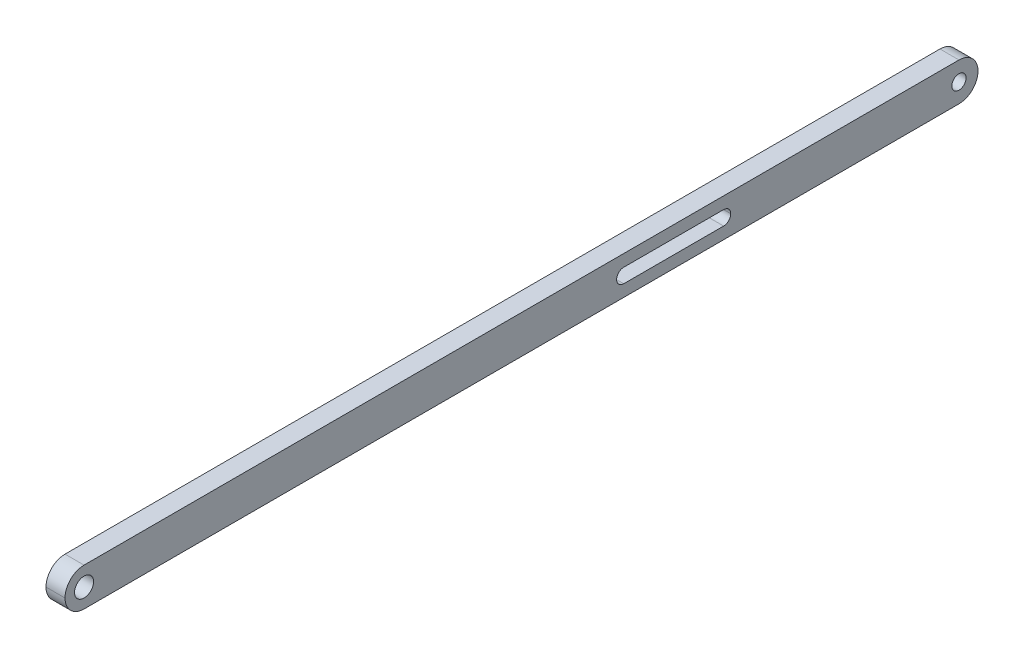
ISO-10303-21;
HEADER;
FILE_DESCRIPTION(('STEP AP214'),'2;1');
FILE_NAME('part.step','',(''),(''),'','','');
FILE_SCHEMA(('AUTOMOTIVE_DESIGN { 1 0 10303 214 1 1 1 1 }'));
ENDSEC;
DATA;
#1=APPLICATION_CONTEXT('core data for automotive mechanical design processes');
#2=APPLICATION_PROTOCOL_DEFINITION('international standard','automotive_design',2000,#1);
#3=PRODUCT_CONTEXT('',#1,'mechanical');
#4=PRODUCT('Part','Part','',(#3));
#5=PRODUCT_RELATED_PRODUCT_CATEGORY('part','',(#4));
#6=PRODUCT_DEFINITION_FORMATION('','',#4);
#7=PRODUCT_DEFINITION_CONTEXT('part definition',#1,'design');
#8=PRODUCT_DEFINITION('design','',#6,#7);
#9=PRODUCT_DEFINITION_SHAPE('','',#8);
#10=(LENGTH_UNIT() NAMED_UNIT(*) SI_UNIT(.MILLI.,.METRE.));
#11=(NAMED_UNIT(*) PLANE_ANGLE_UNIT() SI_UNIT($,.RADIAN.));
#12=(NAMED_UNIT(*) SI_UNIT($,.STERADIAN.) SOLID_ANGLE_UNIT());
#13=UNCERTAINTY_MEASURE_WITH_UNIT(LENGTH_MEASURE(1.E-05),#10,'distance_accuracy_value','');
#14=(GEOMETRIC_REPRESENTATION_CONTEXT(3) GLOBAL_UNCERTAINTY_ASSIGNED_CONTEXT((#13)) GLOBAL_UNIT_ASSIGNED_CONTEXT((#10,
#11,#12)) REPRESENTATION_CONTEXT('',''));
#15=CARTESIAN_POINT('',(0.,0.,0.));
#16=DIRECTION('',(0.,0.,1.));
#17=DIRECTION('',(1.,0.,0.));
#18=AXIS2_PLACEMENT_3D('',#15,#16,#17);
#19=CARTESIAN_POINT('',(0.,0.,-609.6));
#20=DIRECTION('',(-1.,0.,0.));
#21=DIRECTION('',(0.,0.,1.));
#22=AXIS2_PLACEMENT_3D('',#19,#20,#21);
#23=PLANE('',#22);
#24=DIRECTION('',(0.,0.,1.));
#25=VECTOR('',#24,1.);
#26=CARTESIAN_POINT('',(0.,17.4498,-368.3));
#27=LINE('',#26,#25);
#28=CARTESIAN_POINT('',(0.,17.4498,-439.7502));
#29=VERTEX_POINT('',#28);
#30=CARTESIAN_POINT('',(0.,17.4498,-373.0498));
#31=VERTEX_POINT('',#30);
#32=EDGE_CURVE('E175',#29,#31,#27,.T.);
#33=ORIENTED_EDGE('',*,*,#32,.T.);
#34=CARTESIAN_POINT('',(0.,12.7,-373.0498));
#35=DIRECTION('',(-1.,0.,0.));
#36=DIRECTION('',(0.,0.,1.));
#37=AXIS2_PLACEMENT_3D('',#34,#35,#36);
#38=CIRCLE('',#37,4.7498);
#39=CARTESIAN_POINT('',(0.,12.7,-368.3));
#40=VERTEX_POINT('',#39);
#41=EDGE_CURVE('E220',#31,#40,#38,.F.);
#42=ORIENTED_EDGE('',*,*,#41,.T.);
#43=DIRECTION('',(0.,-1.,0.));
#44=VECTOR('',#43,1.);
#45=CARTESIAN_POINT('',(0.,7.9248,-368.3));
#46=LINE('',#45,#44);
#47=CARTESIAN_POINT('',(0.,12.6746,-368.3));
#48=VERTEX_POINT('',#47);
#49=EDGE_CURVE('E163',#40,#48,#46,.T.);
#50=ORIENTED_EDGE('',*,*,#49,.T.);
#51=CARTESIAN_POINT('',(0.,12.6746,-373.0498));
#52=DIRECTION('',(-1.,0.,0.));
#53=DIRECTION('',(0.,0.,1.));
#54=AXIS2_PLACEMENT_3D('',#51,#52,#53);
#55=CIRCLE('',#54,4.7498);
#56=CARTESIAN_POINT('',(0.,7.9248,-373.0498));
#57=VERTEX_POINT('',#56);
#58=EDGE_CURVE('E224',#48,#57,#55,.F.);
#59=ORIENTED_EDGE('',*,*,#58,.T.);
#60=DIRECTION('',(0.,0.,-1.));
#61=VECTOR('',#60,1.);
#62=CARTESIAN_POINT('',(0.,7.9248,-368.3));
#63=LINE('',#62,#61);
#64=CARTESIAN_POINT('',(0.,7.9248,-439.7502));
#65=VERTEX_POINT('',#64);
#66=EDGE_CURVE('E171',#57,#65,#63,.T.);
#67=ORIENTED_EDGE('',*,*,#66,.T.);
#68=CARTESIAN_POINT('',(0.,12.6746,-439.7502));
#69=DIRECTION('',(-1.,0.,0.));
#70=DIRECTION('',(0.,0.,1.));
#71=AXIS2_PLACEMENT_3D('',#68,#69,#70);
#72=CIRCLE('',#71,4.7498);
#73=CARTESIAN_POINT('',(0.,12.6746,-444.5));
#74=VERTEX_POINT('',#73);
#75=EDGE_CURVE('E140',#65,#74,#72,.F.);
#76=ORIENTED_EDGE('',*,*,#75,.T.);
#77=DIRECTION('',(0.,1.,0.));
#78=VECTOR('',#77,1.);
#79=CARTESIAN_POINT('',(0.,7.9248,-444.5));
#80=LINE('',#79,#78);
#81=CARTESIAN_POINT('',(0.,12.7,-444.5));
#82=VERTEX_POINT('',#81);
#83=EDGE_CURVE('E150',#74,#82,#80,.T.);
#84=ORIENTED_EDGE('',*,*,#83,.T.);
#85=CARTESIAN_POINT('',(0.,12.7,-439.7502));
#86=DIRECTION('',(-1.,0.,0.));
#87=DIRECTION('',(0.,0.,1.));
#88=AXIS2_PLACEMENT_3D('',#85,#86,#87);
#89=CIRCLE('',#88,4.7498);
#90=EDGE_CURVE('E216',#82,#29,#89,.F.);
#91=ORIENTED_EDGE('',*,*,#90,.T.);
#92=EDGE_LOOP('',(#33,#42,#50,#59,#67,#76,#84,#91));
#93=FACE_BOUND('',#92,.T.);
#94=CARTESIAN_POINT('',(0.,12.7,-12.7));
#95=DIRECTION('',(-1.,0.,0.));
#96=DIRECTION('',(0.,0.,1.));
#97=AXIS2_PLACEMENT_3D('',#94,#95,#96);
#98=CIRCLE('',#97,6.35);
#99=CARTESIAN_POINT('',(0.,12.7,-6.35));
#100=VERTEX_POINT('',#99);
#101=EDGE_CURVE('E181',#100,#100,#98,.T.);
#102=ORIENTED_EDGE('',*,*,#101,.F.);
#103=EDGE_LOOP('',(#102));
#104=FACE_BOUND('',#103,.T.);
#105=CARTESIAN_POINT('',(0.,12.7,-596.9));
#106=DIRECTION('',(1.,0.,0.));
#107=DIRECTION('',(0.,0.,-1.));
#108=AXIS2_PLACEMENT_3D('',#105,#106,#107);
#109=CIRCLE('',#108,4.76250000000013);
#110=CARTESIAN_POINT('',(0.,12.7,-601.6625));
#111=VERTEX_POINT('',#110);
#112=EDGE_CURVE('E187',#111,#111,#109,.T.);
#113=ORIENTED_EDGE('',*,*,#112,.T.);
#114=EDGE_LOOP('',(#113));
#115=FACE_BOUND('',#114,.T.);
#116=DIRECTION('',(0.,0.,1.));
#117=VECTOR('',#116,1.);
#118=CARTESIAN_POINT('',(0.,0.,-609.6));
#119=LINE('',#118,#117);
#120=CARTESIAN_POINT('',(0.,0.,-596.9));
#121=VERTEX_POINT('',#120);
#122=CARTESIAN_POINT('',(0.,0.,-12.7000000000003));
#123=VERTEX_POINT('',#122);
#124=EDGE_CURVE('E190',#121,#123,#119,.T.);
#125=ORIENTED_EDGE('',*,*,#124,.T.);
#126=CARTESIAN_POINT('',(0.,12.7,-12.7));
#127=DIRECTION('',(-1.,0.,0.));
#128=DIRECTION('',(0.,0.,1.));
#129=AXIS2_PLACEMENT_3D('',#126,#127,#128);
#130=CIRCLE('',#129,12.7);
#131=CARTESIAN_POINT('',(0.,12.7,0.));
#132=VERTEX_POINT('',#131);
#133=EDGE_CURVE('E244',#123,#132,#130,.T.);
#134=ORIENTED_EDGE('',*,*,#133,.T.);
#135=CARTESIAN_POINT('',(0.,12.7,-12.7));
#136=DIRECTION('',(-1.,0.,0.));
#137=DIRECTION('',(0.,0.,1.));
#138=AXIS2_PLACEMENT_3D('',#135,#136,#137);
#139=CIRCLE('',#138,12.7);
#140=CARTESIAN_POINT('',(0.,25.4,-12.7000000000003));
#141=VERTEX_POINT('',#140);
#142=EDGE_CURVE('E51',#132,#141,#139,.T.);
#143=ORIENTED_EDGE('',*,*,#142,.T.);
#144=DIRECTION('',(0.,0.,1.));
#145=VECTOR('',#144,1.);
#146=CARTESIAN_POINT('',(0.,25.4,-609.6));
#147=LINE('',#146,#145);
#148=CARTESIAN_POINT('',(0.,25.4,-596.9));
#149=VERTEX_POINT('',#148);
#150=EDGE_CURVE('E191',#149,#141,#147,.T.);
#151=ORIENTED_EDGE('',*,*,#150,.F.);
#152=CARTESIAN_POINT('',(0.,12.7,-596.9));
#153=DIRECTION('',(-1.,0.,0.));
#154=DIRECTION('',(0.,0.,1.));
#155=AXIS2_PLACEMENT_3D('',#152,#153,#154);
#156=CIRCLE('',#155,12.7);
#157=CARTESIAN_POINT('',(0.,12.7,-609.6));
#158=VERTEX_POINT('',#157);
#159=EDGE_CURVE('E45',#149,#158,#156,.T.);
#160=ORIENTED_EDGE('',*,*,#159,.T.);
#161=CARTESIAN_POINT('',(0.,12.7,-596.9));
#162=DIRECTION('',(-1.,0.,0.));
#163=DIRECTION('',(0.,0.,1.));
#164=AXIS2_PLACEMENT_3D('',#161,#162,#163);
#165=CIRCLE('',#164,12.7);
#166=EDGE_CURVE('E241',#158,#121,#165,.T.);
#167=ORIENTED_EDGE('',*,*,#166,.T.);
#168=EDGE_LOOP('',(#125,#134,#143,#151,#160,#167));
#169=FACE_BOUND('',#168,.T.);
#170=ADVANCED_FACE('F31',(#93,#104,#115,#169),#23,.T.);
#171=CARTESIAN_POINT('',(0.,25.4,-609.6));
#172=DIRECTION('',(0.,1.,0.));
#173=DIRECTION('',(0.,0.,1.));
#174=AXIS2_PLACEMENT_3D('',#171,#172,#173);
#175=PLANE('',#174);
#176=ORIENTED_EDGE('',*,*,#150,.T.);
#177=DIRECTION('',(-1.,0.,0.));
#178=VECTOR('',#177,1.);
#179=CARTESIAN_POINT('',(12.7,25.4,-12.7));
#180=LINE('',#179,#178);
#181=CARTESIAN_POINT('',(12.7,25.4,-12.7000000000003));
#182=VERTEX_POINT('',#181);
#183=EDGE_CURVE('E11',#141,#182,#180,.F.);
#184=ORIENTED_EDGE('',*,*,#183,.T.);
#185=DIRECTION('',(0.,0.,1.));
#186=VECTOR('',#185,1.);
#187=CARTESIAN_POINT('',(12.7,25.4,-609.6));
#188=LINE('',#187,#186);
#189=CARTESIAN_POINT('',(12.7,25.4,-596.9));
#190=VERTEX_POINT('',#189);
#191=EDGE_CURVE('E193',#190,#182,#188,.T.);
#192=ORIENTED_EDGE('',*,*,#191,.F.);
#193=DIRECTION('',(-1.,0.,0.));
#194=VECTOR('',#193,1.);
#195=CARTESIAN_POINT('',(0.,25.4,-596.9));
#196=LINE('',#195,#194);
#197=EDGE_CURVE('E38',#190,#149,#196,.T.);
#198=ORIENTED_EDGE('',*,*,#197,.T.);
#199=EDGE_LOOP('',(#176,#184,#192,#198));
#200=FACE_BOUND('',#199,.T.);
#201=ADVANCED_FACE('F248',(#200),#175,.T.);
#202=CARTESIAN_POINT('',(12.7,0.,-609.6));
#203=DIRECTION('',(1.,0.,0.));
#204=DIRECTION('',(0.,0.,-1.));
#205=AXIS2_PLACEMENT_3D('',#202,#203,#204);
#206=PLANE('',#205);
#207=DIRECTION('',(0.,-1.,0.));
#208=VECTOR('',#207,1.);
#209=CARTESIAN_POINT('',(12.7,7.9248,-368.3));
#210=LINE('',#209,#208);
#211=CARTESIAN_POINT('',(12.7,12.7,-368.3));
#212=VERTEX_POINT('',#211);
#213=CARTESIAN_POINT('',(12.7,12.6746,-368.3));
#214=VERTEX_POINT('',#213);
#215=EDGE_CURVE('E165',#212,#214,#210,.T.);
#216=ORIENTED_EDGE('',*,*,#215,.F.);
#217=CARTESIAN_POINT('',(12.7,12.7,-373.0498));
#218=DIRECTION('',(1.,0.,0.));
#219=DIRECTION('',(0.,0.,-1.));
#220=AXIS2_PLACEMENT_3D('',#217,#218,#219);
#221=CIRCLE('',#220,4.7498);
#222=CARTESIAN_POINT('',(12.7,17.4498,-373.0498));
#223=VERTEX_POINT('',#222);
#224=EDGE_CURVE('E218',#212,#223,#221,.F.);
#225=ORIENTED_EDGE('',*,*,#224,.T.);
#226=DIRECTION('',(0.,0.,1.));
#227=VECTOR('',#226,1.);
#228=CARTESIAN_POINT('',(12.7,17.4498,-368.3));
#229=LINE('',#228,#227);
#230=CARTESIAN_POINT('',(12.7,17.4498,-439.7502));
#231=VERTEX_POINT('',#230);
#232=EDGE_CURVE('E159',#231,#223,#229,.T.);
#233=ORIENTED_EDGE('',*,*,#232,.F.);
#234=CARTESIAN_POINT('',(12.7,12.7,-439.7502));
#235=DIRECTION('',(1.,0.,0.));
#236=DIRECTION('',(0.,0.,-1.));
#237=AXIS2_PLACEMENT_3D('',#234,#235,#236);
#238=CIRCLE('',#237,4.7498);
#239=CARTESIAN_POINT('',(12.7,12.7,-444.5));
#240=VERTEX_POINT('',#239);
#241=EDGE_CURVE('E158',#231,#240,#238,.F.);
#242=ORIENTED_EDGE('',*,*,#241,.T.);
#243=DIRECTION('',(0.,1.,0.));
#244=VECTOR('',#243,1.);
#245=CARTESIAN_POINT('',(12.7,7.9248,-444.5));
#246=LINE('',#245,#244);
#247=CARTESIAN_POINT('',(12.7,12.6746,-444.5));
#248=VERTEX_POINT('',#247);
#249=EDGE_CURVE('E147',#248,#240,#246,.T.);
#250=ORIENTED_EDGE('',*,*,#249,.F.);
#251=CARTESIAN_POINT('',(12.7,12.6746,-439.7502));
#252=DIRECTION('',(1.,0.,0.));
#253=DIRECTION('',(0.,0.,-1.));
#254=AXIS2_PLACEMENT_3D('',#251,#252,#253);
#255=CIRCLE('',#254,4.7498);
#256=CARTESIAN_POINT('',(12.7,7.9248,-439.7502));
#257=VERTEX_POINT('',#256);
#258=EDGE_CURVE('E130',#248,#257,#255,.F.);
#259=ORIENTED_EDGE('',*,*,#258,.T.);
#260=DIRECTION('',(0.,0.,-1.));
#261=VECTOR('',#260,1.);
#262=CARTESIAN_POINT('',(12.7,7.9248,-368.3));
#263=LINE('',#262,#261);
#264=CARTESIAN_POINT('',(12.7,7.9248,-373.0498));
#265=VERTEX_POINT('',#264);
#266=EDGE_CURVE('E160',#265,#257,#263,.T.);
#267=ORIENTED_EDGE('',*,*,#266,.F.);
#268=CARTESIAN_POINT('',(12.7,12.6746,-373.0498));
#269=DIRECTION('',(1.,0.,0.));
#270=DIRECTION('',(0.,0.,-1.));
#271=AXIS2_PLACEMENT_3D('',#268,#269,#270);
#272=CIRCLE('',#271,4.7498);
#273=EDGE_CURVE('E222',#265,#214,#272,.F.);
#274=ORIENTED_EDGE('',*,*,#273,.T.);
#275=EDGE_LOOP('',(#216,#225,#233,#242,#250,#259,#267,#274));
#276=FACE_BOUND('',#275,.T.);
#277=CARTESIAN_POINT('',(12.7,12.7,-12.7));
#278=DIRECTION('',(1.,0.,0.));
#279=DIRECTION('',(0.,0.,-1.));
#280=AXIS2_PLACEMENT_3D('',#277,#278,#279);
#281=CIRCLE('',#280,6.35);
#282=CARTESIAN_POINT('',(12.7,12.7,-19.05));
#283=VERTEX_POINT('',#282);
#284=EDGE_CURVE('E178',#283,#283,#281,.T.);
#285=ORIENTED_EDGE('',*,*,#284,.F.);
#286=EDGE_LOOP('',(#285));
#287=FACE_BOUND('',#286,.T.);
#288=CARTESIAN_POINT('',(12.7,12.7,-596.9));
#289=DIRECTION('',(1.,0.,0.));
#290=DIRECTION('',(0.,0.,-1.));
#291=AXIS2_PLACEMENT_3D('',#288,#289,#290);
#292=CIRCLE('',#291,4.76250000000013);
#293=CARTESIAN_POINT('',(12.7,12.7,-601.6625));
#294=VERTEX_POINT('',#293);
#295=EDGE_CURVE('E184',#294,#294,#292,.T.);
#296=ORIENTED_EDGE('',*,*,#295,.F.);
#297=EDGE_LOOP('',(#296));
#298=FACE_BOUND('',#297,.T.);
#299=CARTESIAN_POINT('',(12.7,12.7,-12.7));
#300=DIRECTION('',(1.,0.,0.));
#301=DIRECTION('',(0.,0.,-1.));
#302=AXIS2_PLACEMENT_3D('',#299,#300,#301);
#303=CIRCLE('',#302,12.7);
#304=CARTESIAN_POINT('',(12.7,12.7,0.));
#305=VERTEX_POINT('',#304);
#306=EDGE_CURVE('E230',#182,#305,#303,.T.);
#307=ORIENTED_EDGE('',*,*,#306,.T.);
#308=CARTESIAN_POINT('',(12.7,12.7,-12.7));
#309=DIRECTION('',(1.,0.,0.));
#310=DIRECTION('',(0.,0.,-1.));
#311=AXIS2_PLACEMENT_3D('',#308,#309,#310);
#312=CIRCLE('',#311,12.7);
#313=CARTESIAN_POINT('',(12.7,0.,-12.7000000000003));
#314=VERTEX_POINT('',#313);
#315=EDGE_CURVE('E232',#305,#314,#312,.T.);
#316=ORIENTED_EDGE('',*,*,#315,.T.);
#317=DIRECTION('',(0.,0.,1.));
#318=VECTOR('',#317,1.);
#319=CARTESIAN_POINT('',(12.7,0.,-609.6));
#320=LINE('',#319,#318);
#321=CARTESIAN_POINT('',(12.7,0.,-596.9));
#322=VERTEX_POINT('',#321);
#323=EDGE_CURVE('E196',#322,#314,#320,.T.);
#324=ORIENTED_EDGE('',*,*,#323,.F.);
#325=CARTESIAN_POINT('',(12.7,12.7,-596.9));
#326=DIRECTION('',(1.,0.,0.));
#327=DIRECTION('',(0.,0.,-1.));
#328=AXIS2_PLACEMENT_3D('',#325,#326,#327);
#329=CIRCLE('',#328,12.7);
#330=CARTESIAN_POINT('',(12.7,12.7,-609.6));
#331=VERTEX_POINT('',#330);
#332=EDGE_CURVE('E228',#322,#331,#329,.T.);
#333=ORIENTED_EDGE('',*,*,#332,.T.);
#334=CARTESIAN_POINT('',(12.7,12.7,-596.9));
#335=DIRECTION('',(1.,0.,0.));
#336=DIRECTION('',(0.,0.,-1.));
#337=AXIS2_PLACEMENT_3D('',#334,#335,#336);
#338=CIRCLE('',#337,12.7);
#339=EDGE_CURVE('E226',#331,#190,#338,.T.);
#340=ORIENTED_EDGE('',*,*,#339,.T.);
#341=ORIENTED_EDGE('',*,*,#191,.T.);
#342=EDGE_LOOP('',(#307,#316,#324,#333,#340,#341));
#343=FACE_BOUND('',#342,.T.);
#344=ADVANCED_FACE('F155',(#276,#287,#298,#343),#206,.T.);
#345=CARTESIAN_POINT('',(0.,0.,-609.6));
#346=DIRECTION('',(0.,-1.,0.));
#347=DIRECTION('',(0.,0.,-1.));
#348=AXIS2_PLACEMENT_3D('',#345,#346,#347);
#349=PLANE('',#348);
#350=ORIENTED_EDGE('',*,*,#323,.T.);
#351=DIRECTION('',(1.,0.,0.));
#352=VECTOR('',#351,1.);
#353=CARTESIAN_POINT('',(0.,0.,-12.7));
#354=LINE('',#353,#352);
#355=EDGE_CURVE('E237',#314,#123,#354,.F.);
#356=ORIENTED_EDGE('',*,*,#355,.T.);
#357=ORIENTED_EDGE('',*,*,#124,.F.);
#358=DIRECTION('',(1.,0.,0.));
#359=VECTOR('',#358,1.);
#360=CARTESIAN_POINT('',(0.,0.,-596.9));
#361=LINE('',#360,#359);
#362=EDGE_CURVE('E234',#121,#322,#361,.T.);
#363=ORIENTED_EDGE('',*,*,#362,.T.);
#364=EDGE_LOOP('',(#350,#356,#357,#363));
#365=FACE_BOUND('',#364,.T.);
#366=ADVANCED_FACE('F263',(#365),#349,.T.);
#367=CARTESIAN_POINT('',(0.,12.7,-596.9));
#368=DIRECTION('',(1.,0.,0.));
#369=DIRECTION('',(0.,0.,-1.));
#370=AXIS2_PLACEMENT_3D('',#367,#368,#369);
#371=CYLINDRICAL_SURFACE('',#370,4.76250000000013);
#372=ORIENTED_EDGE('',*,*,#112,.F.);
#373=EDGE_LOOP('',(#372));
#374=FACE_BOUND('',#373,.T.);
#375=ORIENTED_EDGE('',*,*,#295,.T.);
#376=EDGE_LOOP('',(#375));
#377=FACE_BOUND('',#376,.T.);
#378=ADVANCED_FACE('F281',(#374,#377),#371,.F.);
#379=CARTESIAN_POINT('',(-495.3,12.7,-12.7));
#380=DIRECTION('',(1.,0.,0.));
#381=DIRECTION('',(0.,0.,-1.));
#382=AXIS2_PLACEMENT_3D('',#379,#380,#381);
#383=CYLINDRICAL_SURFACE('',#382,6.35);
#384=ORIENTED_EDGE('',*,*,#101,.T.);
#385=EDGE_LOOP('',(#384));
#386=FACE_BOUND('',#385,.T.);
#387=ORIENTED_EDGE('',*,*,#284,.T.);
#388=EDGE_LOOP('',(#387));
#389=FACE_BOUND('',#388,.T.);
#390=ADVANCED_FACE('F296',(#386,#389),#383,.F.);
#391=CARTESIAN_POINT('',(0.,7.9248,-368.3));
#392=DIRECTION('',(0.,0.,1.));
#393=DIRECTION('',(1.,0.,0.));
#394=AXIS2_PLACEMENT_3D('',#391,#392,#393);
#395=PLANE('',#394);
#396=ORIENTED_EDGE('',*,*,#49,.F.);
#397=DIRECTION('',(1.,0.,0.));
#398=VECTOR('',#397,1.);
#399=CARTESIAN_POINT('',(12.7,12.7,-368.3));
#400=LINE('',#399,#398);
#401=EDGE_CURVE('E141',#40,#212,#400,.T.);
#402=ORIENTED_EDGE('',*,*,#401,.T.);
#403=ORIENTED_EDGE('',*,*,#215,.T.);
#404=DIRECTION('',(1.,0.,0.));
#405=VECTOR('',#404,1.);
#406=CARTESIAN_POINT('',(0.,12.6746,-368.3));
#407=LINE('',#406,#405);
#408=EDGE_CURVE('E210',#214,#48,#407,.F.);
#409=ORIENTED_EDGE('',*,*,#408,.T.);
#410=EDGE_LOOP('',(#396,#402,#403,#409));
#411=FACE_BOUND('',#410,.T.);
#412=ADVANCED_FACE('F303',(#411),#395,.F.);
#413=CARTESIAN_POINT('',(0.,17.4498,-368.3));
#414=DIRECTION('',(0.,1.,0.));
#415=DIRECTION('',(0.,0.,1.));
#416=AXIS2_PLACEMENT_3D('',#413,#414,#415);
#417=PLANE('',#416);
#418=ORIENTED_EDGE('',*,*,#32,.F.);
#419=DIRECTION('',(1.,0.,0.));
#420=VECTOR('',#419,1.);
#421=CARTESIAN_POINT('',(12.7,17.4498,-439.7502));
#422=LINE('',#421,#420);
#423=EDGE_CURVE('E207',#29,#231,#422,.T.);
#424=ORIENTED_EDGE('',*,*,#423,.T.);
#425=ORIENTED_EDGE('',*,*,#232,.T.);
#426=DIRECTION('',(1.,0.,0.));
#427=VECTOR('',#426,1.);
#428=CARTESIAN_POINT('',(0.,17.4498,-373.0498));
#429=LINE('',#428,#427);
#430=EDGE_CURVE('E205',#223,#31,#429,.F.);
#431=ORIENTED_EDGE('',*,*,#430,.T.);
#432=EDGE_LOOP('',(#418,#424,#425,#431));
#433=FACE_BOUND('',#432,.T.);
#434=ADVANCED_FACE('F309',(#433),#417,.F.);
#435=CARTESIAN_POINT('',(0.,7.9248,-444.5));
#436=DIRECTION('',(0.,0.,-1.));
#437=DIRECTION('',(-1.,0.,0.));
#438=AXIS2_PLACEMENT_3D('',#435,#436,#437);
#439=PLANE('',#438);
#440=ORIENTED_EDGE('',*,*,#83,.F.);
#441=DIRECTION('',(1.,0.,0.));
#442=VECTOR('',#441,1.);
#443=CARTESIAN_POINT('',(12.7,12.6746,-444.5));
#444=LINE('',#443,#442);
#445=EDGE_CURVE('E134',#74,#248,#444,.T.);
#446=ORIENTED_EDGE('',*,*,#445,.T.);
#447=ORIENTED_EDGE('',*,*,#249,.T.);
#448=DIRECTION('',(1.,0.,0.));
#449=VECTOR('',#448,1.);
#450=CARTESIAN_POINT('',(0.,12.7,-444.5));
#451=LINE('',#450,#449);
#452=EDGE_CURVE('E152',#240,#82,#451,.F.);
#453=ORIENTED_EDGE('',*,*,#452,.T.);
#454=EDGE_LOOP('',(#440,#446,#447,#453));
#455=FACE_BOUND('',#454,.T.);
#456=ADVANCED_FACE('F146',(#455),#439,.F.);
#457=CARTESIAN_POINT('',(0.,7.9248,-368.3));
#458=DIRECTION('',(0.,-1.,0.));
#459=DIRECTION('',(0.,0.,-1.));
#460=AXIS2_PLACEMENT_3D('',#457,#458,#459);
#461=PLANE('',#460);
#462=ORIENTED_EDGE('',*,*,#266,.T.);
#463=DIRECTION('',(1.,0.,0.));
#464=VECTOR('',#463,1.);
#465=CARTESIAN_POINT('',(0.,7.9248,-439.7502));
#466=LINE('',#465,#464);
#467=EDGE_CURVE('E135',#257,#65,#466,.F.);
#468=ORIENTED_EDGE('',*,*,#467,.T.);
#469=ORIENTED_EDGE('',*,*,#66,.F.);
#470=DIRECTION('',(1.,0.,0.));
#471=VECTOR('',#470,1.);
#472=CARTESIAN_POINT('',(12.7,7.9248,-373.0498));
#473=LINE('',#472,#471);
#474=EDGE_CURVE('E151',#57,#265,#473,.T.);
#475=ORIENTED_EDGE('',*,*,#474,.T.);
#476=EDGE_LOOP('',(#462,#468,#469,#475));
#477=FACE_BOUND('',#476,.T.);
#478=ADVANCED_FACE('F311',(#477),#461,.F.);
#479=CARTESIAN_POINT('',(0.,12.6746,-439.7502));
#480=DIRECTION('',(-1.,0.,0.));
#481=DIRECTION('',(0.,0.,1.));
#482=AXIS2_PLACEMENT_3D('',#479,#480,#481);
#483=CYLINDRICAL_SURFACE('',#482,4.7498);
#484=ORIENTED_EDGE('',*,*,#75,.F.);
#485=ORIENTED_EDGE('',*,*,#467,.F.);
#486=ORIENTED_EDGE('',*,*,#258,.F.);
#487=ORIENTED_EDGE('',*,*,#445,.F.);
#488=EDGE_LOOP('',(#484,#485,#486,#487));
#489=FACE_BOUND('',#488,.T.);
#490=ADVANCED_FACE('F133',(#489),#483,.F.);
#491=CARTESIAN_POINT('',(0.,12.7,-439.7502));
#492=DIRECTION('',(-1.,0.,0.));
#493=DIRECTION('',(0.,0.,1.));
#494=AXIS2_PLACEMENT_3D('',#491,#492,#493);
#495=CYLINDRICAL_SURFACE('',#494,4.7498);
#496=ORIENTED_EDGE('',*,*,#90,.F.);
#497=ORIENTED_EDGE('',*,*,#452,.F.);
#498=ORIENTED_EDGE('',*,*,#241,.F.);
#499=ORIENTED_EDGE('',*,*,#423,.F.);
#500=EDGE_LOOP('',(#496,#497,#498,#499));
#501=FACE_BOUND('',#500,.T.);
#502=ADVANCED_FACE('F322',(#501),#495,.F.);
#503=CARTESIAN_POINT('',(0.,12.7,-373.0498));
#504=DIRECTION('',(-1.,0.,0.));
#505=DIRECTION('',(0.,0.,1.));
#506=AXIS2_PLACEMENT_3D('',#503,#504,#505);
#507=CYLINDRICAL_SURFACE('',#506,4.7498);
#508=ORIENTED_EDGE('',*,*,#41,.F.);
#509=ORIENTED_EDGE('',*,*,#430,.F.);
#510=ORIENTED_EDGE('',*,*,#224,.F.);
#511=ORIENTED_EDGE('',*,*,#401,.F.);
#512=EDGE_LOOP('',(#508,#509,#510,#511));
#513=FACE_BOUND('',#512,.T.);
#514=ADVANCED_FACE('F325',(#513),#507,.F.);
#515=CARTESIAN_POINT('',(0.,12.6746,-373.0498));
#516=DIRECTION('',(-1.,0.,0.));
#517=DIRECTION('',(0.,0.,1.));
#518=AXIS2_PLACEMENT_3D('',#515,#516,#517);
#519=CYLINDRICAL_SURFACE('',#518,4.7498);
#520=ORIENTED_EDGE('',*,*,#58,.F.);
#521=ORIENTED_EDGE('',*,*,#408,.F.);
#522=ORIENTED_EDGE('',*,*,#273,.F.);
#523=ORIENTED_EDGE('',*,*,#474,.F.);
#524=EDGE_LOOP('',(#520,#521,#522,#523));
#525=FACE_BOUND('',#524,.T.);
#526=ADVANCED_FACE('F329',(#525),#519,.F.);
#527=CARTESIAN_POINT('',(0.,12.7,-12.7));
#528=DIRECTION('',(1.,0.,0.));
#529=DIRECTION('',(0.,0.,-1.));
#530=AXIS2_PLACEMENT_3D('',#527,#528,#529);
#531=CYLINDRICAL_SURFACE('',#530,12.7);
#532=ORIENTED_EDGE('',*,*,#183,.F.);
#533=ORIENTED_EDGE('',*,*,#142,.F.);
#534=DIRECTION('',(-1.,0.,0.));
#535=VECTOR('',#534,1.);
#536=CARTESIAN_POINT('',(0.,12.7,0.));
#537=LINE('',#536,#535);
#538=EDGE_CURVE('E257',#305,#132,#537,.T.);
#539=ORIENTED_EDGE('',*,*,#538,.F.);
#540=ORIENTED_EDGE('',*,*,#306,.F.);
#541=EDGE_LOOP('',(#532,#533,#539,#540));
#542=FACE_BOUND('',#541,.T.);
#543=ADVANCED_FACE('F272',(#542),#531,.T.);
#544=CARTESIAN_POINT('',(0.,12.7,-12.7));
#545=DIRECTION('',(-1.,0.,0.));
#546=DIRECTION('',(0.,0.,1.));
#547=AXIS2_PLACEMENT_3D('',#544,#545,#546);
#548=CYLINDRICAL_SURFACE('',#547,12.7);
#549=ORIENTED_EDGE('',*,*,#133,.F.);
#550=ORIENTED_EDGE('',*,*,#355,.F.);
#551=ORIENTED_EDGE('',*,*,#315,.F.);
#552=ORIENTED_EDGE('',*,*,#538,.T.);
#553=EDGE_LOOP('',(#549,#550,#551,#552));
#554=FACE_BOUND('',#553,.T.);
#555=ADVANCED_FACE('F268',(#554),#548,.T.);
#556=CARTESIAN_POINT('',(0.,12.7,-596.9));
#557=DIRECTION('',(-1.,0.,0.));
#558=DIRECTION('',(0.,0.,1.));
#559=AXIS2_PLACEMENT_3D('',#556,#557,#558);
#560=CYLINDRICAL_SURFACE('',#559,12.7);
#561=DIRECTION('',(-1.,0.,0.));
#562=VECTOR('',#561,1.);
#563=CARTESIAN_POINT('',(0.,12.7,-609.6));
#564=LINE('',#563,#562);
#565=EDGE_CURVE('E254',#158,#331,#564,.F.);
#566=ORIENTED_EDGE('',*,*,#565,.F.);
#567=ORIENTED_EDGE('',*,*,#159,.F.);
#568=ORIENTED_EDGE('',*,*,#197,.F.);
#569=ORIENTED_EDGE('',*,*,#339,.F.);
#570=EDGE_LOOP('',(#566,#567,#568,#569));
#571=FACE_BOUND('',#570,.T.);
#572=ADVANCED_FACE('F252',(#571),#560,.T.);
#573=CARTESIAN_POINT('',(0.,12.7,-596.9));
#574=DIRECTION('',(1.,0.,0.));
#575=DIRECTION('',(0.,0.,-1.));
#576=AXIS2_PLACEMENT_3D('',#573,#574,#575);
#577=CYLINDRICAL_SURFACE('',#576,12.7);
#578=ORIENTED_EDGE('',*,*,#166,.F.);
#579=ORIENTED_EDGE('',*,*,#565,.T.);
#580=ORIENTED_EDGE('',*,*,#332,.F.);
#581=ORIENTED_EDGE('',*,*,#362,.F.);
#582=EDGE_LOOP('',(#578,#579,#580,#581));
#583=FACE_BOUND('',#582,.T.);
#584=ADVANCED_FACE('F260',(#583),#577,.T.);
#585=CLOSED_SHELL('',(#170,#201,#344,#366,#378,#390,#412,#434,#456,#478,#490,#502,#514,#526,
#543,#555,#572,#584));
#586=MANIFOLD_SOLID_BREP('B2',#585);
#587=ADVANCED_BREP_SHAPE_REPRESENTATION('',(#18,#586),#14);
#588=SHAPE_DEFINITION_REPRESENTATION(#9,#587);
ENDSEC;
END-ISO-10303-21;
